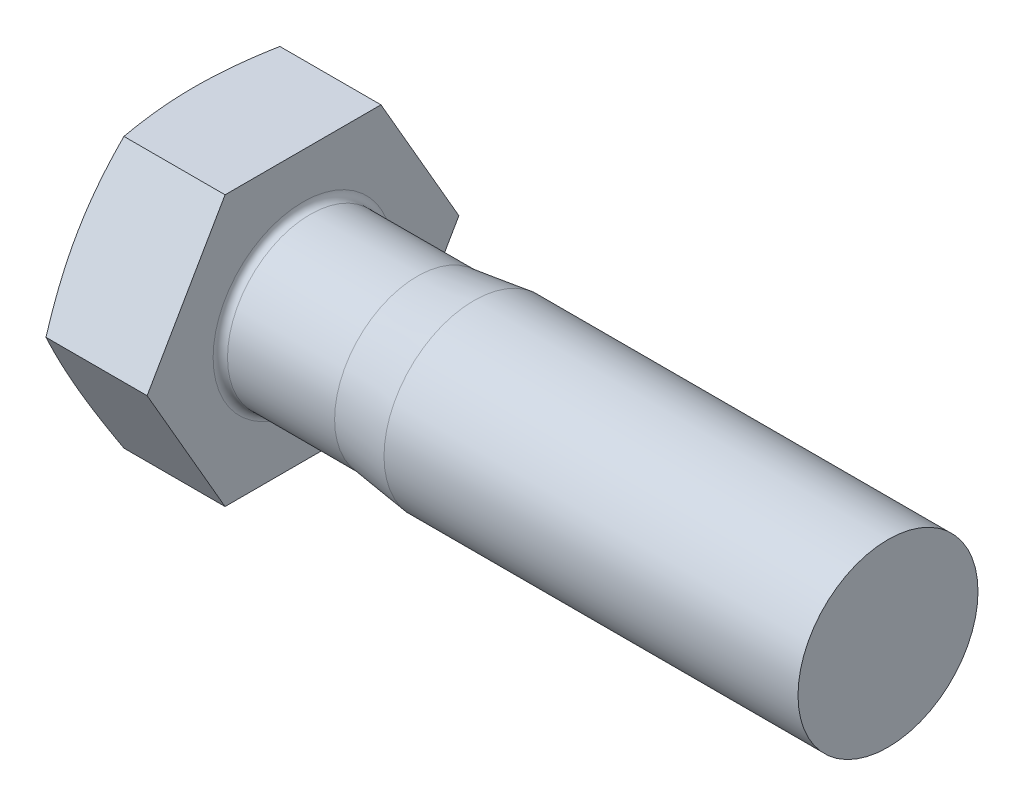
ISO-10303-21;
HEADER;
FILE_DESCRIPTION(('STEP AP214'),'2;1');
FILE_NAME('part.step','',(''),(''),'','','');
FILE_SCHEMA(('AUTOMOTIVE_DESIGN { 1 0 10303 214 1 1 1 1 }'));
ENDSEC;
DATA;
#1=APPLICATION_CONTEXT('core data for automotive mechanical design processes');
#2=APPLICATION_PROTOCOL_DEFINITION('international standard','automotive_design',2000,#1);
#3=PRODUCT_CONTEXT('',#1,'mechanical');
#4=PRODUCT('Part','Part','',(#3));
#5=PRODUCT_RELATED_PRODUCT_CATEGORY('part','',(#4));
#6=PRODUCT_DEFINITION_FORMATION('','',#4);
#7=PRODUCT_DEFINITION_CONTEXT('part definition',#1,'design');
#8=PRODUCT_DEFINITION('design','',#6,#7);
#9=PRODUCT_DEFINITION_SHAPE('','',#8);
#10=(LENGTH_UNIT() NAMED_UNIT(*) SI_UNIT(.MILLI.,.METRE.));
#11=(NAMED_UNIT(*) PLANE_ANGLE_UNIT() SI_UNIT($,.RADIAN.));
#12=(NAMED_UNIT(*) SI_UNIT($,.STERADIAN.) SOLID_ANGLE_UNIT());
#13=UNCERTAINTY_MEASURE_WITH_UNIT(LENGTH_MEASURE(1.E-05),#10,'distance_accuracy_value','');
#14=(GEOMETRIC_REPRESENTATION_CONTEXT(3) GLOBAL_UNCERTAINTY_ASSIGNED_CONTEXT((#13)) GLOBAL_UNIT_ASSIGNED_CONTEXT((#10,
#11,#12)) REPRESENTATION_CONTEXT('',''));
#15=CARTESIAN_POINT('',(0.,0.,0.));
#16=DIRECTION('',(0.,0.,1.));
#17=DIRECTION('',(1.,0.,0.));
#18=AXIS2_PLACEMENT_3D('',#15,#16,#17);
#19=CARTESIAN_POINT('',(12.5,-15.,-8.66025403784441));
#20=DIRECTION('',(0.,0.5,0.866025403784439));
#21=DIRECTION('',(0.,-0.866025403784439,0.5));
#22=AXIS2_PLACEMENT_3D('',#19,#20,#21);
#23=PLANE('',#22);
#24=CARTESIAN_POINT('',(1.26320366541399,0.000200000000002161,-17.3206235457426));
#25=CARTESIAN_POINT('',(1.1979300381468,-0.310443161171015,-17.1412736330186));
#26=CARTESIAN_POINT('',(1.13559192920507,-0.621542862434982,-16.9616601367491));
#27=CARTESIAN_POINT('',(1.01743252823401,-1.24469773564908,-16.6018815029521));
#28=CARTESIAN_POINT('',(0.961611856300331,-1.55675299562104,-16.4217163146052));
#29=CARTESIAN_POINT('',(0.804840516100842,-2.49475901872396,-15.8801582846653));
#30=CARTESIAN_POINT('',(0.714672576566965,-3.12212058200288,-15.517950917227));
#31=CARTESIAN_POINT('',(0.605089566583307,-4.06237563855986,-14.9750944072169));
#32=CARTESIAN_POINT('',(0.572932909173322,-4.37418429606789,-14.795071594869));
#33=CARTESIAN_POINT('',(0.5174007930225,-4.99838379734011,-14.4346898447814));
#34=CARTESIAN_POINT('',(0.494024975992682,-5.31077461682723,-14.2543309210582));
#35=CARTESIAN_POINT('',(0.456462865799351,-5.93586386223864,-13.8934354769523));
#36=CARTESIAN_POINT('',(0.442273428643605,-6.24856214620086,-13.7128990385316));
#37=CARTESIAN_POINT('',(0.423324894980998,-6.87417362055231,-13.3517020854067));
#38=CARTESIAN_POINT('',(0.418565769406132,-7.18708681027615,-13.1710415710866));
#39=CARTESIAN_POINT('',(0.418565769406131,-7.81291318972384,-12.8097205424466));
#40=CARTESIAN_POINT('',(0.423324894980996,-8.12582637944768,-12.6290600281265));
#41=CARTESIAN_POINT('',(0.442273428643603,-8.75143785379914,-12.2678630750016));
#42=CARTESIAN_POINT('',(0.45646286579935,-9.06413613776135,-12.0873266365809));
#43=CARTESIAN_POINT('',(0.49402497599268,-9.68922538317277,-11.726431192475));
#44=CARTESIAN_POINT('',(0.517400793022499,-10.0016162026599,-11.5460722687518));
#45=CARTESIAN_POINT('',(0.57293290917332,-10.6258157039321,-11.1856905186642));
#46=CARTESIAN_POINT('',(0.605089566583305,-10.9376243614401,-11.0056677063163));
#47=CARTESIAN_POINT('',(0.714672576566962,-11.8778794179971,-10.4628111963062));
#48=CARTESIAN_POINT('',(0.804840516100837,-12.505240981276,-10.1006038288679));
#49=CARTESIAN_POINT('',(0.961611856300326,-13.443247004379,-9.55904579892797));
#50=CARTESIAN_POINT('',(1.017432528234,-13.7553022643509,-9.37888061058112));
#51=CARTESIAN_POINT('',(1.13559192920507,-14.378457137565,-9.01910197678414));
#52=CARTESIAN_POINT('',(1.19793003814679,-14.689556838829,-8.83948848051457));
#53=CARTESIAN_POINT('',(1.26320366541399,-15.0002,-8.66013856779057));
#54=B_SPLINE_CURVE_WITH_KNOTS('',3,(#24,#25,#26,#27,#28,#29,#30,#31,#32,#33,#34,#35,#36,#37,#38,
#39,#40,#41,#42,#43,#44,#45,#46,#47,#48,#49,#50,#51,#52,#53),.UNSPECIFIED.,.F.,.F.,(4,2,2,2,2,2,
2,2,2,2,2,2,2,2,4),(0.,1.0937389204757,2.18758181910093,4.37677976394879,5.46113055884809,
6.54543710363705,7.62937235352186,8.71330426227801,9.79723617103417,10.881171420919,
11.9654779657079,13.0498287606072,15.2390267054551,16.3328696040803,17.426608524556),.UNSPECIFIED.);
#55=CARTESIAN_POINT('',(1.26316163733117,0.,-17.3205080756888));
#56=VERTEX_POINT('',#55);
#57=CARTESIAN_POINT('',(1.26316163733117,-15.,-8.66025403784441));
#58=VERTEX_POINT('',#57);
#59=EDGE_CURVE('E47',#56,#58,#54,.T.);
#60=ORIENTED_EDGE('',*,*,#59,.F.);
#61=DIRECTION('',(-1.,0.,0.));
#62=VECTOR('',#61,1.);
#63=CARTESIAN_POINT('',(12.5,0.,-17.3205080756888));
#64=LINE('',#63,#62);
#65=CARTESIAN_POINT('',(12.5,0.,-17.3205080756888));
#66=VERTEX_POINT('',#65);
#67=EDGE_CURVE('E118',#66,#56,#64,.T.);
#68=ORIENTED_EDGE('',*,*,#67,.F.);
#69=DIRECTION('',(0.,0.866025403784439,-0.5));
#70=VECTOR('',#69,1.);
#71=CARTESIAN_POINT('',(12.5,-15.,-8.66025403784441));
#72=LINE('',#71,#70);
#73=CARTESIAN_POINT('',(12.5,-15.,-8.66025403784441));
#74=VERTEX_POINT('',#73);
#75=EDGE_CURVE('E157',#74,#66,#72,.T.);
#76=ORIENTED_EDGE('',*,*,#75,.F.);
#77=DIRECTION('',(-1.,0.,0.));
#78=VECTOR('',#77,1.);
#79=CARTESIAN_POINT('',(12.5,-15.,-8.66025403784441));
#80=LINE('',#79,#78);
#81=EDGE_CURVE('E112',#74,#58,#80,.T.);
#82=ORIENTED_EDGE('',*,*,#81,.T.);
#83=EDGE_LOOP('',(#60,#68,#76,#82));
#84=FACE_BOUND('',#83,.T.);
#85=ADVANCED_FACE('F32',(#84),#23,.F.);
#86=CARTESIAN_POINT('',(12.5,0.,-17.3205080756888));
#87=DIRECTION('',(0.,-0.5,0.866025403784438));
#88=DIRECTION('',(0.,-0.866025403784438,-0.5));
#89=AXIS2_PLACEMENT_3D('',#86,#87,#88);
#90=PLANE('',#89);
#91=CARTESIAN_POINT('',(1.26320366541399,15.0002,-8.66013856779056));
#92=CARTESIAN_POINT('',(1.19793003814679,14.689556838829,-8.83948848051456));
#93=CARTESIAN_POINT('',(1.13559192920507,14.378457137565,-9.01910197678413));
#94=CARTESIAN_POINT('',(1.017432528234,13.7553022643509,-9.37888061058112));
#95=CARTESIAN_POINT('',(0.961611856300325,13.443247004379,-9.55904579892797));
#96=CARTESIAN_POINT('',(0.804840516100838,12.505240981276,-10.1006038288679));
#97=CARTESIAN_POINT('',(0.71467257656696,11.8778794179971,-10.4628111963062));
#98=CARTESIAN_POINT('',(0.605089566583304,10.9376243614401,-11.0056677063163));
#99=CARTESIAN_POINT('',(0.572932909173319,10.6258157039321,-11.1856905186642));
#100=CARTESIAN_POINT('',(0.517400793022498,10.0016162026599,-11.5460722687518));
#101=CARTESIAN_POINT('',(0.49402497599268,9.68922538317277,-11.726431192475));
#102=CARTESIAN_POINT('',(0.456462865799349,9.06413613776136,-12.0873266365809));
#103=CARTESIAN_POINT('',(0.442273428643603,8.75143785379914,-12.2678630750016));
#104=CARTESIAN_POINT('',(0.423324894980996,8.12582637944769,-12.6290600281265));
#105=CARTESIAN_POINT('',(0.41856576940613,7.81291318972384,-12.8097205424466));
#106=CARTESIAN_POINT('',(0.418565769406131,7.18708681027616,-13.1710415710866));
#107=CARTESIAN_POINT('',(0.423324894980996,6.87417362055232,-13.3517020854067));
#108=CARTESIAN_POINT('',(0.442273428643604,6.24856214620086,-13.7128990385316));
#109=CARTESIAN_POINT('',(0.456462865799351,5.93586386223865,-13.8934354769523));
#110=CARTESIAN_POINT('',(0.494024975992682,5.31077461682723,-14.2543309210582));
#111=CARTESIAN_POINT('',(0.5174007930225,4.99838379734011,-14.4346898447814));
#112=CARTESIAN_POINT('',(0.572932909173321,4.37418429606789,-14.795071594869));
#113=CARTESIAN_POINT('',(0.605089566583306,4.06237563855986,-14.9750944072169));
#114=CARTESIAN_POINT('',(0.714672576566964,3.12212058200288,-15.517950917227));
#115=CARTESIAN_POINT('',(0.804840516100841,2.49475901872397,-15.8801582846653));
#116=CARTESIAN_POINT('',(0.96161185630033,1.55675299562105,-16.4217163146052));
#117=CARTESIAN_POINT('',(1.017432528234,1.24469773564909,-16.6018815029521));
#118=CARTESIAN_POINT('',(1.13559192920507,0.621542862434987,-16.9616601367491));
#119=CARTESIAN_POINT('',(1.1979300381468,0.31044316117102,-17.1412736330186));
#120=CARTESIAN_POINT('',(1.26320366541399,-0.000199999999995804,-17.3206235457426));
#121=B_SPLINE_CURVE_WITH_KNOTS('',3,(#91,#92,#93,#94,#95,#96,#97,#98,#99,#100,#101,#102,#103,
#104,#105,#106,#107,#108,#109,#110,#111,#112,#113,#114,#115,#116,#117,#118,#119,#120),
.UNSPECIFIED.,.F.,.F.,(4,2,2,2,2,2,2,2,2,2,2,2,2,2,4),(0.,1.0937389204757,2.18758181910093,
4.37677976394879,5.46113055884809,6.54543710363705,7.62937235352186,8.71330426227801,
9.79723617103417,10.881171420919,11.9654779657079,13.0498287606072,15.2390267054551,
16.3328696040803,17.426608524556),.UNSPECIFIED.);
#122=CARTESIAN_POINT('',(1.26316163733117,15.,-8.66025403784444));
#123=VERTEX_POINT('',#122);
#124=EDGE_CURVE('E150',#123,#56,#121,.T.);
#125=ORIENTED_EDGE('',*,*,#124,.F.);
#126=DIRECTION('',(-1.,0.,0.));
#127=VECTOR('',#126,1.);
#128=CARTESIAN_POINT('',(12.5,15.,-8.6602540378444));
#129=LINE('',#128,#127);
#130=CARTESIAN_POINT('',(12.5,15.,-8.6602540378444));
#131=VERTEX_POINT('',#130);
#132=EDGE_CURVE('E110',#131,#123,#129,.T.);
#133=ORIENTED_EDGE('',*,*,#132,.F.);
#134=DIRECTION('',(0.,0.866025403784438,0.5));
#135=VECTOR('',#134,1.);
#136=CARTESIAN_POINT('',(12.5,0.,-17.3205080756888));
#137=LINE('',#136,#135);
#138=EDGE_CURVE('E154',#66,#131,#137,.T.);
#139=ORIENTED_EDGE('',*,*,#138,.F.);
#140=ORIENTED_EDGE('',*,*,#67,.T.);
#141=EDGE_LOOP('',(#125,#133,#139,#140));
#142=FACE_BOUND('',#141,.T.);
#143=ADVANCED_FACE('F139',(#142),#90,.F.);
#144=CARTESIAN_POINT('',(12.5,15.,-8.6602540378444));
#145=DIRECTION('',(0.,-1.,0.));
#146=DIRECTION('',(0.,0.,-1.));
#147=AXIS2_PLACEMENT_3D('',#144,#145,#146);
#148=PLANE('',#147);
#149=CARTESIAN_POINT('',(4.91961642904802,15.,-22.88945697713));
#150=CARTESIAN_POINT('',(4.81638202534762,15.,-22.5503381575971));
#151=CARTESIAN_POINT('',(4.71377422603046,15.,-22.2110286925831));
#152=CARTESIAN_POINT('',(4.50995213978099,15.,-21.5319894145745));
#153=CARTESIAN_POINT('',(4.40873786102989,15.,-21.1922595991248));
#154=CARTESIAN_POINT('',(4.10738262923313,15.,-20.1723364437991));
#155=CARTESIAN_POINT('',(3.9095446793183,15.,-19.4914598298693));
#156=CARTESIAN_POINT('',(3.52106014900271,15.,-18.1262692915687));
#157=CARTESIAN_POINT('',(3.3304277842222,15.,-17.4419513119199));
#158=CARTESIAN_POINT('',(2.95858022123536,15.,-16.0707644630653));
#159=CARTESIAN_POINT('',(2.7773648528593,15.,-15.383895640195));
#160=CARTESIAN_POINT('',(2.42886947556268,15.,-14.0157131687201));
#161=CARTESIAN_POINT('',(2.26144414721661,15.,-13.3344367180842));
#162=CARTESIAN_POINT('',(1.94090770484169,15.,-11.9684892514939));
#163=CARTESIAN_POINT('',(1.78779683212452,15.,-11.283818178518));
#164=CARTESIAN_POINT('',(1.49947213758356,15.,-9.91093551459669));
#165=CARTESIAN_POINT('',(1.3642520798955,15.,-9.22272524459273));
#166=CARTESIAN_POINT('',(1.11583728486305,15.,-7.84231132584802));
#167=CARTESIAN_POINT('',(1.00264180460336,15.,-7.15010781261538));
#168=CARTESIAN_POINT('',(0.814095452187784,15.,-5.83972391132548));
#169=CARTESIAN_POINT('',(0.735923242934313,15.,-5.22195329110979));
#170=CARTESIAN_POINT('',(0.603729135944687,15.,-3.98381199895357));
#171=CARTESIAN_POINT('',(0.549706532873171,15.,-3.36344140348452));
#172=CARTESIAN_POINT('',(0.468413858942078,15.,-2.12135926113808));
#173=CARTESIAN_POINT('',(0.441125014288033,15.,-1.49964896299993));
#174=CARTESIAN_POINT('',(0.414680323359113,15.,-0.25562387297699));
#175=CARTESIAN_POINT('',(0.415524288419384,15.,0.366690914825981));
#176=CARTESIAN_POINT('',(0.445375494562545,15.,1.61382375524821));
#177=CARTESIAN_POINT('',(0.47452701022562,15.,2.23863829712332));
#178=CARTESIAN_POINT('',(0.559653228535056,15.,3.4864216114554));
#179=CARTESIAN_POINT('',(0.615628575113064,15.,4.10939033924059));
#180=CARTESIAN_POINT('',(0.75179235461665,15.,5.35317883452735));
#181=CARTESIAN_POINT('',(0.832001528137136,15.,5.97399629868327));
#182=CARTESIAN_POINT('',(1.01339112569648,15.,7.21252509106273));
#183=CARTESIAN_POINT('',(1.11457165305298,15.,7.83023640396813));
#184=CARTESIAN_POINT('',(1.3410206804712,15.,9.09829177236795));
#185=CARTESIAN_POINT('',(1.4673476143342,15.,9.74844514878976));
#186=CARTESIAN_POINT('',(1.73625904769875,15.,11.0454025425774));
#187=CARTESIAN_POINT('',(1.87884478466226,15.,11.6922063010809));
#188=CARTESIAN_POINT('',(2.1772678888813,15.,12.982930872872));
#189=CARTESIAN_POINT('',(2.3331091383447,15.,13.6268507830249));
#190=CARTESIAN_POINT('',(2.65550076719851,15.,14.9119744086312));
#191=CARTESIAN_POINT('',(2.82205088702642,15.,15.553178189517));
#192=CARTESIAN_POINT('',(3.16407229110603,15.,16.8340800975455));
#193=CARTESIAN_POINT('',(3.33955481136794,15.,17.4737752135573));
#194=CARTESIAN_POINT('',(3.6976366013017,15.,18.7511677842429));
#195=CARTESIAN_POINT('',(3.88023590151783,15.,19.3888652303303));
#196=CARTESIAN_POINT('',(4.25124466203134,15.,20.6624469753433));
#197=CARTESIAN_POINT('',(4.43965313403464,15.,21.2983315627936));
#198=CARTESIAN_POINT('',(4.82129800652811,15.,22.5686463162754));
#199=CARTESIAN_POINT('',(5.01453439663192,15.,23.2030764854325));
#200=CARTESIAN_POINT('',(5.40282045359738,15.,24.4635306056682));
#201=CARTESIAN_POINT('',(5.59782491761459,15.,25.0895684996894));
#202=CARTESIAN_POINT('',(5.99114351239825,15.,26.3406044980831));
#203=CARTESIAN_POINT('',(6.18945765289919,15.,26.9656025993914));
#204=CARTESIAN_POINT('',(6.78859722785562,15.,28.8393146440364));
#205=CARTESIAN_POINT('',(7.19360294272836,15.,30.086691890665));
#206=CARTESIAN_POINT('',(8.01018214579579,15.,32.5740343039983));
#207=CARTESIAN_POINT('',(8.42172481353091,15.,33.8140096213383));
#208=CARTESIAN_POINT('',(9.04358172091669,15.,35.6723940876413));
#209=CARTESIAN_POINT('',(9.25161601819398,15.,36.29156752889));
#210=CARTESIAN_POINT('',(9.66902287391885,15.,37.5294615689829));
#211=CARTESIAN_POINT('',(9.87839542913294,15.,38.1481821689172));
#212=CARTESIAN_POINT('',(10.0883469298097,15.,38.7667061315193));
#213=B_SPLINE_CURVE_WITH_KNOTS('',3,(#149,#150,#151,#152,#153,#154,#155,#156,#157,#158,#159,
#160,#161,#162,#163,#164,#165,#166,#167,#168,#169,#170,#171,#172,#173,#174,#175,#176,#177,#178,
#179,#180,#181,#182,#183,#184,#185,#186,#187,#188,#189,#190,#191,#192,#193,#194,#195,#196,#197,
#198,#199,#200,#201,#202,#203,#204,#205,#206,#207,#208,#209,#210,#211,#212),.UNSPECIFIED.,.F.,
.F.,(4,2,2,2,2,2,2,2,2,2,2,2,2,2,2,2,2,2,2,2,2,2,2,2,2,2,2,2,2,2,2,4),(0.,1.06345090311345,
2.12690804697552,4.25398052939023,6.38505099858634,8.51608294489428,10.6206032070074,
12.7251589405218,14.8289791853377,16.9327284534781,18.8004079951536,20.6680329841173,
22.5343454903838,24.4006454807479,26.2765076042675,28.1524147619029,30.0299319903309,
31.9074584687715,33.8941406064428,35.8809740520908,37.8683914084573,39.8557606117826,
41.8456946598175,43.8356372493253,45.8252431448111,47.8148447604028,49.7819514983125,
51.7490640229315,55.6834600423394,59.6028993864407,61.5624608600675,63.5220176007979),.UNSPECIFIED.);
#214=CARTESIAN_POINT('',(1.26316163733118,15.0000000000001,8.66025403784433));
#215=VERTEX_POINT('',#214);
#216=EDGE_CURVE('E104',#215,#123,#213,.F.);
#217=ORIENTED_EDGE('',*,*,#216,.F.);
#218=DIRECTION('',(-1.,0.,0.));
#219=VECTOR('',#218,1.);
#220=CARTESIAN_POINT('',(12.5,15.,8.66025403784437));
#221=LINE('',#220,#219);
#222=CARTESIAN_POINT('',(12.5,15.,8.66025403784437));
#223=VERTEX_POINT('',#222);
#224=EDGE_CURVE('E103',#223,#215,#221,.T.);
#225=ORIENTED_EDGE('',*,*,#224,.F.);
#226=DIRECTION('',(0.,0.,1.));
#227=VECTOR('',#226,1.);
#228=CARTESIAN_POINT('',(12.5,15.,-8.6602540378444));
#229=LINE('',#228,#227);
#230=EDGE_CURVE('E156',#131,#223,#229,.T.);
#231=ORIENTED_EDGE('',*,*,#230,.F.);
#232=ORIENTED_EDGE('',*,*,#132,.T.);
#233=EDGE_LOOP('',(#217,#225,#231,#232));
#234=FACE_BOUND('',#233,.T.);
#235=ADVANCED_FACE('F144',(#234),#148,.F.);
#236=CARTESIAN_POINT('',(12.5,15.,8.66025403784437));
#237=DIRECTION('',(0.,-0.5,-0.866025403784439));
#238=DIRECTION('',(0.,0.866025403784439,-0.5));
#239=AXIS2_PLACEMENT_3D('',#236,#237,#238);
#240=PLANE('',#239);
#241=CARTESIAN_POINT('',(1.26320366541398,-0.000199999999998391,17.3206235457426));
#242=CARTESIAN_POINT('',(1.19793003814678,0.310443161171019,17.1412736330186));
#243=CARTESIAN_POINT('',(1.13559192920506,0.621542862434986,16.961660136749));
#244=CARTESIAN_POINT('',(1.01743252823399,1.24469773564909,16.601881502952));
#245=CARTESIAN_POINT('',(0.961611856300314,1.55675299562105,16.4217163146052));
#246=CARTESIAN_POINT('',(0.804840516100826,2.49475901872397,15.8801582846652));
#247=CARTESIAN_POINT('',(0.714672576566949,3.12212058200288,15.5179509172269));
#248=CARTESIAN_POINT('',(0.605089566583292,4.06237563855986,14.9750944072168));
#249=CARTESIAN_POINT('',(0.572932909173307,4.37418429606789,14.7950715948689));
#250=CARTESIAN_POINT('',(0.517400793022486,4.99838379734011,14.4346898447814));
#251=CARTESIAN_POINT('',(0.494024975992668,5.31077461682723,14.2543309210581));
#252=CARTESIAN_POINT('',(0.456462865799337,5.93586386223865,13.8934354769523));
#253=CARTESIAN_POINT('',(0.442273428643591,6.24856214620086,13.7128990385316));
#254=CARTESIAN_POINT('',(0.423324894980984,6.87417362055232,13.3517020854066));
#255=CARTESIAN_POINT('',(0.418565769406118,7.18708681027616,13.1710415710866));
#256=CARTESIAN_POINT('',(0.418565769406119,7.81291318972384,12.8097205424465));
#257=CARTESIAN_POINT('',(0.423324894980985,8.12582637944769,12.6290600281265));
#258=CARTESIAN_POINT('',(0.442273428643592,8.75143785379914,12.2678630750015));
#259=CARTESIAN_POINT('',(0.456462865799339,9.06413613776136,12.0873266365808));
#260=CARTESIAN_POINT('',(0.494024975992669,9.68922538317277,11.726431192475));
#261=CARTESIAN_POINT('',(0.517400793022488,10.0016162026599,11.5460722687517));
#262=CARTESIAN_POINT('',(0.572932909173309,10.6258157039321,11.1856905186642));
#263=CARTESIAN_POINT('',(0.605089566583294,10.9376243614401,11.0056677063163));
#264=CARTESIAN_POINT('',(0.714672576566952,11.8778794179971,10.4628111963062));
#265=CARTESIAN_POINT('',(0.804840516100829,12.505240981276,10.1006038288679));
#266=CARTESIAN_POINT('',(0.961611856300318,13.443247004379,9.55904579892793));
#267=CARTESIAN_POINT('',(1.01743252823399,13.7553022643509,9.37888061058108));
#268=CARTESIAN_POINT('',(1.13559192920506,14.378457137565,9.01910197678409));
#269=CARTESIAN_POINT('',(1.19793003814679,14.689556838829,8.83948848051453));
#270=CARTESIAN_POINT('',(1.26320366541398,15.0002,8.66013856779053));
#271=B_SPLINE_CURVE_WITH_KNOTS('',3,(#241,#242,#243,#244,#245,#246,#247,#248,#249,#250,#251,
#252,#253,#254,#255,#256,#257,#258,#259,#260,#261,#262,#263,#264,#265,#266,#267,#268,#269,#270),
.UNSPECIFIED.,.F.,.F.,(4,2,2,2,2,2,2,2,2,2,2,2,2,2,4),(0.,1.0937389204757,2.18758181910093,
4.37677976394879,5.46113055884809,6.54543710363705,7.62937235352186,8.71330426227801,
9.79723617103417,10.881171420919,11.9654779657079,13.0498287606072,15.2390267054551,
16.3328696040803,17.426608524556),.UNSPECIFIED.);
#272=CARTESIAN_POINT('',(1.26316163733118,0.,17.3205080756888));
#273=VERTEX_POINT('',#272);
#274=EDGE_CURVE('E87',#273,#215,#271,.T.);
#275=ORIENTED_EDGE('',*,*,#274,.F.);
#276=DIRECTION('',(-1.,0.,0.));
#277=VECTOR('',#276,1.);
#278=CARTESIAN_POINT('',(12.5,0.,17.3205080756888));
#279=LINE('',#278,#277);
#280=CARTESIAN_POINT('',(12.5,0.,17.3205080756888));
#281=VERTEX_POINT('',#280);
#282=EDGE_CURVE('E100',#281,#273,#279,.T.);
#283=ORIENTED_EDGE('',*,*,#282,.F.);
#284=DIRECTION('',(0.,-0.866025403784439,0.5));
#285=VECTOR('',#284,1.);
#286=CARTESIAN_POINT('',(12.5,15.,8.66025403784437));
#287=LINE('',#286,#285);
#288=EDGE_CURVE('E164',#223,#281,#287,.T.);
#289=ORIENTED_EDGE('',*,*,#288,.F.);
#290=ORIENTED_EDGE('',*,*,#224,.T.);
#291=EDGE_LOOP('',(#275,#283,#289,#290));
#292=FACE_BOUND('',#291,.T.);
#293=ADVANCED_FACE('F98',(#292),#240,.F.);
#294=CARTESIAN_POINT('',(12.5,0.,17.3205080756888));
#295=DIRECTION('',(0.,0.5,-0.866025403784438));
#296=DIRECTION('',(0.,0.866025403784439,0.5));
#297=AXIS2_PLACEMENT_3D('',#294,#295,#296);
#298=PLANE('',#297);
#299=CARTESIAN_POINT('',(1.26320366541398,-15.0002,8.66013856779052));
#300=CARTESIAN_POINT('',(1.19793003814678,-14.689556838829,8.83948848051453));
#301=CARTESIAN_POINT('',(1.13559192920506,-14.378457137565,9.01910197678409));
#302=CARTESIAN_POINT('',(1.01743252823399,-13.7553022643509,9.37888061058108));
#303=CARTESIAN_POINT('',(0.961611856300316,-13.443247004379,9.55904579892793));
#304=CARTESIAN_POINT('',(0.804840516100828,-12.505240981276,10.1006038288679));
#305=CARTESIAN_POINT('',(0.714672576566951,-11.8778794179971,10.4628111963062));
#306=CARTESIAN_POINT('',(0.605089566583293,-10.9376243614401,11.0056677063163));
#307=CARTESIAN_POINT('',(0.572932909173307,-10.6258157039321,11.1856905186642));
#308=CARTESIAN_POINT('',(0.517400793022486,-10.0016162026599,11.5460722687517));
#309=CARTESIAN_POINT('',(0.494024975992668,-9.68922538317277,11.726431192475));
#310=CARTESIAN_POINT('',(0.456462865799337,-9.06413613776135,12.0873266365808));
#311=CARTESIAN_POINT('',(0.44227342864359,-8.75143785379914,12.2678630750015));
#312=CARTESIAN_POINT('',(0.423324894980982,-8.12582637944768,12.6290600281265));
#313=CARTESIAN_POINT('',(0.418565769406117,-7.81291318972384,12.8097205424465));
#314=CARTESIAN_POINT('',(0.418565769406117,-7.18708681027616,13.1710415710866));
#315=CARTESIAN_POINT('',(0.423324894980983,-6.87417362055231,13.3517020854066));
#316=CARTESIAN_POINT('',(0.44227342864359,-6.24856214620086,13.7128990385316));
#317=CARTESIAN_POINT('',(0.456462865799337,-5.93586386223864,13.8934354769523));
#318=CARTESIAN_POINT('',(0.494024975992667,-5.31077461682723,14.2543309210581));
#319=CARTESIAN_POINT('',(0.517400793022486,-4.99838379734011,14.4346898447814));
#320=CARTESIAN_POINT('',(0.572932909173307,-4.37418429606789,14.7950715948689));
#321=CARTESIAN_POINT('',(0.605089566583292,-4.06237563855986,14.9750944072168));
#322=CARTESIAN_POINT('',(0.714672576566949,-3.12212058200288,15.5179509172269));
#323=CARTESIAN_POINT('',(0.804840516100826,-2.49475901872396,15.8801582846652));
#324=CARTESIAN_POINT('',(0.961611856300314,-1.55675299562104,16.4217163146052));
#325=CARTESIAN_POINT('',(1.01743252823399,-1.24469773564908,16.601881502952));
#326=CARTESIAN_POINT('',(1.13559192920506,-0.621542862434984,16.961660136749));
#327=CARTESIAN_POINT('',(1.19793003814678,-0.310443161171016,17.1412736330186));
#328=CARTESIAN_POINT('',(1.26320366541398,0.000200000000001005,17.3206235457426));
#329=B_SPLINE_CURVE_WITH_KNOTS('',3,(#299,#300,#301,#302,#303,#304,#305,#306,#307,#308,#309,
#310,#311,#312,#313,#314,#315,#316,#317,#318,#319,#320,#321,#322,#323,#324,#325,#326,#327,#328),
.UNSPECIFIED.,.F.,.F.,(4,2,2,2,2,2,2,2,2,2,2,2,2,2,4),(0.,1.0937389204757,2.18758181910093,
4.37677976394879,5.46113055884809,6.54543710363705,7.62937235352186,8.71330426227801,
9.79723617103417,10.881171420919,11.9654779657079,13.0498287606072,15.2390267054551,
16.3328696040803,17.426608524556),.UNSPECIFIED.);
#330=CARTESIAN_POINT('',(1.26316163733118,-15.,8.66025403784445));
#331=VERTEX_POINT('',#330);
#332=EDGE_CURVE('E84',#331,#273,#329,.T.);
#333=ORIENTED_EDGE('',*,*,#332,.F.);
#334=DIRECTION('',(-1.,0.,0.));
#335=VECTOR('',#334,1.);
#336=CARTESIAN_POINT('',(12.5,-15.,8.66025403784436));
#337=LINE('',#336,#335);
#338=CARTESIAN_POINT('',(12.5,-15.,8.66025403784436));
#339=VERTEX_POINT('',#338);
#340=EDGE_CURVE('E108',#339,#331,#337,.T.);
#341=ORIENTED_EDGE('',*,*,#340,.F.);
#342=DIRECTION('',(0.,-0.866025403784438,-0.5));
#343=VECTOR('',#342,1.);
#344=CARTESIAN_POINT('',(12.5,0.,17.3205080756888));
#345=LINE('',#344,#343);
#346=EDGE_CURVE('E107',#281,#339,#345,.T.);
#347=ORIENTED_EDGE('',*,*,#346,.F.);
#348=ORIENTED_EDGE('',*,*,#282,.T.);
#349=EDGE_LOOP('',(#333,#341,#347,#348));
#350=FACE_BOUND('',#349,.T.);
#351=ADVANCED_FACE('F106',(#350),#298,.F.);
#352=CARTESIAN_POINT('',(12.5,-15.,8.66025403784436));
#353=DIRECTION('',(0.,1.,0.));
#354=DIRECTION('',(0.,0.,1.));
#355=AXIS2_PLACEMENT_3D('',#352,#353,#354);
#356=PLANE('',#355);
#357=CARTESIAN_POINT('',(4.91961642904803,-15.,-22.88945697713));
#358=CARTESIAN_POINT('',(4.81638202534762,-15.,-22.5503381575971));
#359=CARTESIAN_POINT('',(4.71377422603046,-15.,-22.2110286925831));
#360=CARTESIAN_POINT('',(4.509952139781,-15.,-21.5319894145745));
#361=CARTESIAN_POINT('',(4.4087378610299,-15.,-21.1922595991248));
#362=CARTESIAN_POINT('',(4.10738262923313,-15.,-20.1723364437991));
#363=CARTESIAN_POINT('',(3.9095446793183,-15.,-19.4914598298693));
#364=CARTESIAN_POINT('',(3.52106014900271,-15.,-18.1262692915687));
#365=CARTESIAN_POINT('',(3.3304277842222,-15.,-17.4419513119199));
#366=CARTESIAN_POINT('',(2.95858022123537,-15.,-16.0707644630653));
#367=CARTESIAN_POINT('',(2.7773648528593,-15.,-15.383895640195));
#368=CARTESIAN_POINT('',(2.42886947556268,-15.,-14.0157131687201));
#369=CARTESIAN_POINT('',(2.26144414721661,-15.,-13.3344367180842));
#370=CARTESIAN_POINT('',(1.94090770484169,-15.,-11.9684892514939));
#371=CARTESIAN_POINT('',(1.78779683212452,-15.,-11.283818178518));
#372=CARTESIAN_POINT('',(1.49947213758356,-15.,-9.91093551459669));
#373=CARTESIAN_POINT('',(1.3642520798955,-15.,-9.22272524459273));
#374=CARTESIAN_POINT('',(1.11583728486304,-15.,-7.84231132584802));
#375=CARTESIAN_POINT('',(1.00264180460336,-15.,-7.15010781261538));
#376=CARTESIAN_POINT('',(0.814095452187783,-15.,-5.83972391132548));
#377=CARTESIAN_POINT('',(0.735923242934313,-15.,-5.2219532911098));
#378=CARTESIAN_POINT('',(0.603729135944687,-15.,-3.98381199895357));
#379=CARTESIAN_POINT('',(0.54970653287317,-15.,-3.36344140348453));
#380=CARTESIAN_POINT('',(0.468413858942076,-15.,-2.12135926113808));
#381=CARTESIAN_POINT('',(0.441125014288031,-15.,-1.49964896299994));
#382=CARTESIAN_POINT('',(0.414680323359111,-15.,-0.255623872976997));
#383=CARTESIAN_POINT('',(0.415524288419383,-15.,0.366690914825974));
#384=CARTESIAN_POINT('',(0.445375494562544,-15.,1.6138237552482));
#385=CARTESIAN_POINT('',(0.474527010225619,-15.,2.23863829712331));
#386=CARTESIAN_POINT('',(0.559653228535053,-15.,3.48642161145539));
#387=CARTESIAN_POINT('',(0.615628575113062,-15.,4.10939033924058));
#388=CARTESIAN_POINT('',(0.751792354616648,-15.,5.35317883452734));
#389=CARTESIAN_POINT('',(0.832001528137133,-15.,5.97399629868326));
#390=CARTESIAN_POINT('',(1.01339112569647,-15.,7.21252509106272));
#391=CARTESIAN_POINT('',(1.11457165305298,-15.,7.83023640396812));
#392=CARTESIAN_POINT('',(1.3410206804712,-15.,9.09829177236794));
#393=CARTESIAN_POINT('',(1.4673476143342,-15.,9.74844514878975));
#394=CARTESIAN_POINT('',(1.73625904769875,-15.,11.0454025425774));
#395=CARTESIAN_POINT('',(1.87884478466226,-15.,11.6922063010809));
#396=CARTESIAN_POINT('',(2.1772678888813,-15.,12.9829308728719));
#397=CARTESIAN_POINT('',(2.3331091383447,-15.,13.6268507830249));
#398=CARTESIAN_POINT('',(2.65550076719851,-15.,14.9119744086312));
#399=CARTESIAN_POINT('',(2.82205088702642,-15.,15.553178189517));
#400=CARTESIAN_POINT('',(3.16407229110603,-15.,16.8340800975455));
#401=CARTESIAN_POINT('',(3.33955481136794,-15.,17.4737752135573));
#402=CARTESIAN_POINT('',(3.6976366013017,-15.,18.7511677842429));
#403=CARTESIAN_POINT('',(3.88023590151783,-15.,19.3888652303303));
#404=CARTESIAN_POINT('',(4.25124466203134,-15.,20.6624469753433));
#405=CARTESIAN_POINT('',(4.43965313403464,-15.,21.2983315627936));
#406=CARTESIAN_POINT('',(4.82129800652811,-15.,22.5686463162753));
#407=CARTESIAN_POINT('',(5.01453439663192,-15.,23.2030764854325));
#408=CARTESIAN_POINT('',(5.40282045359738,-15.,24.4635306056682));
#409=CARTESIAN_POINT('',(5.59782491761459,-15.,25.0895684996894));
#410=CARTESIAN_POINT('',(5.99114351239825,-15.,26.3406044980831));
#411=CARTESIAN_POINT('',(6.18945765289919,-15.,26.9656025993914));
#412=CARTESIAN_POINT('',(6.78859722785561,-15.,28.8393146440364));
#413=CARTESIAN_POINT('',(7.19360294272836,-15.,30.086691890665));
#414=CARTESIAN_POINT('',(8.01018214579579,-15.,32.5740343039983));
#415=CARTESIAN_POINT('',(8.4217248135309,-15.,33.8140096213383));
#416=CARTESIAN_POINT('',(9.04358172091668,-15.,35.6723940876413));
#417=CARTESIAN_POINT('',(9.25161601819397,-15.,36.29156752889));
#418=CARTESIAN_POINT('',(9.66902287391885,-15.,37.5294615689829));
#419=CARTESIAN_POINT('',(9.87839542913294,-15.,38.1481821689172));
#420=CARTESIAN_POINT('',(10.0883469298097,-15.,38.7667061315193));
#421=B_SPLINE_CURVE_WITH_KNOTS('',3,(#357,#358,#359,#360,#361,#362,#363,#364,#365,#366,#367,
#368,#369,#370,#371,#372,#373,#374,#375,#376,#377,#378,#379,#380,#381,#382,#383,#384,#385,#386,
#387,#388,#389,#390,#391,#392,#393,#394,#395,#396,#397,#398,#399,#400,#401,#402,#403,#404,#405,
#406,#407,#408,#409,#410,#411,#412,#413,#414,#415,#416,#417,#418,#419,#420),.UNSPECIFIED.,.F.,
.F.,(4,2,2,2,2,2,2,2,2,2,2,2,2,2,2,2,2,2,2,2,2,2,2,2,2,2,2,2,2,2,2,4),(0.,1.06345090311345,
2.12690804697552,4.25398052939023,6.38505099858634,8.51608294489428,10.6206032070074,
12.7251589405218,14.8289791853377,16.9327284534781,18.8004079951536,20.6680329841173,
22.5343454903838,24.4006454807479,26.2765076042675,28.1524147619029,30.0299319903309,
31.9074584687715,33.8941406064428,35.8809740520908,37.8683914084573,39.8557606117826,
41.8456946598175,43.8356372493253,45.8252431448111,47.8148447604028,49.7819514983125,
51.7490640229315,55.6834600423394,59.6028993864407,61.5624608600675,63.5220176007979),.UNSPECIFIED.);
#422=EDGE_CURVE('E89',#58,#331,#421,.T.);
#423=ORIENTED_EDGE('',*,*,#422,.F.);
#424=ORIENTED_EDGE('',*,*,#81,.F.);
#425=DIRECTION('',(0.,0.,-1.));
#426=VECTOR('',#425,1.);
#427=CARTESIAN_POINT('',(12.5,-15.,8.66025403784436));
#428=LINE('',#427,#426);
#429=EDGE_CURVE('E55',#339,#74,#428,.T.);
#430=ORIENTED_EDGE('',*,*,#429,.F.);
#431=ORIENTED_EDGE('',*,*,#340,.T.);
#432=EDGE_LOOP('',(#423,#424,#430,#431));
#433=FACE_BOUND('',#432,.T.);
#434=ADVANCED_FACE('F168',(#433),#356,.F.);
#435=CARTESIAN_POINT('',(12.5,0.,-17.3205080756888));
#436=DIRECTION('',(1.,0.,0.));
#437=DIRECTION('',(0.,0.,-1.));
#438=AXIS2_PLACEMENT_3D('',#435,#436,#437);
#439=PLANE('',#438);
#440=CARTESIAN_POINT('',(12.5,0.,0.));
#441=DIRECTION('',(1.,0.,0.));
#442=DIRECTION('',(0.,0.,-1.));
#443=AXIS2_PLACEMENT_3D('',#440,#441,#442);
#444=CIRCLE('',#443,9.988);
#445=CARTESIAN_POINT('',(12.5,0.,-9.988));
#446=VERTEX_POINT('',#445);
#447=EDGE_CURVE('E40',#446,#446,#444,.F.);
#448=ORIENTED_EDGE('',*,*,#447,.T.);
#449=EDGE_LOOP('',(#448));
#450=FACE_BOUND('',#449,.T.);
#451=ORIENTED_EDGE('',*,*,#75,.T.);
#452=ORIENTED_EDGE('',*,*,#138,.T.);
#453=ORIENTED_EDGE('',*,*,#230,.T.);
#454=ORIENTED_EDGE('',*,*,#288,.T.);
#455=ORIENTED_EDGE('',*,*,#346,.T.);
#456=ORIENTED_EDGE('',*,*,#429,.T.);
#457=EDGE_LOOP('',(#451,#452,#453,#454,#455,#456));
#458=FACE_BOUND('',#457,.T.);
#459=ADVANCED_FACE('F123',(#450,#458),#439,.T.);
#460=CARTESIAN_POINT('',(0.,0.,0.));
#461=DIRECTION('',(1.,0.,0.));
#462=DIRECTION('',(0.,0.,-1.));
#463=AXIS2_PLACEMENT_3D('',#460,#461,#462);
#464=CONICAL_SURFACE('',#463,13.85,1.22173047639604);
#465=CARTESIAN_POINT('',(0.,0.,0.));
#466=DIRECTION('',(-1.,0.,0.));
#467=DIRECTION('',(0.,0.,1.));
#468=AXIS2_PLACEMENT_3D('',#465,#466,#467);
#469=CIRCLE('',#468,13.85);
#470=CARTESIAN_POINT('',(0.,0.,13.85));
#471=VERTEX_POINT('',#470);
#472=EDGE_CURVE('E169',#471,#471,#469,.T.);
#473=ORIENTED_EDGE('',*,*,#472,.F.);
#474=EDGE_LOOP('',(#473));
#475=FACE_BOUND('',#474,.T.);
#476=ORIENTED_EDGE('',*,*,#59,.T.);
#477=ORIENTED_EDGE('',*,*,#422,.T.);
#478=ORIENTED_EDGE('',*,*,#332,.T.);
#479=ORIENTED_EDGE('',*,*,#274,.T.);
#480=ORIENTED_EDGE('',*,*,#216,.T.);
#481=ORIENTED_EDGE('',*,*,#124,.T.);
#482=EDGE_LOOP('',(#476,#477,#478,#479,#480,#481));
#483=FACE_BOUND('',#482,.T.);
#484=ADVANCED_FACE('F86',(#475,#483),#464,.T.);
#485=CARTESIAN_POINT('',(0.,0.,-17.3205080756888));
#486=DIRECTION('',(1.,0.,0.));
#487=DIRECTION('',(0.,0.,-1.));
#488=AXIS2_PLACEMENT_3D('',#485,#486,#487);
#489=PLANE('',#488);
#490=CARTESIAN_POINT('',(0.,0.,0.));
#491=DIRECTION('',(-1.,0.,0.));
#492=DIRECTION('',(0.,0.,1.));
#493=AXIS2_PLACEMENT_3D('',#490,#491,#492);
#494=CIRCLE('',#493,11.2);
#495=CARTESIAN_POINT('',(0.,0.,11.2));
#496=VERTEX_POINT('',#495);
#497=EDGE_CURVE('E242',#496,#496,#494,.T.);
#498=ORIENTED_EDGE('',*,*,#497,.F.);
#499=EDGE_LOOP('',(#498));
#500=FACE_BOUND('',#499,.T.);
#501=ORIENTED_EDGE('',*,*,#472,.T.);
#502=EDGE_LOOP('',(#501));
#503=FACE_BOUND('',#502,.T.);
#504=ADVANCED_FACE('F190',(#500,#503),#489,.F.);
#505=CARTESIAN_POINT('',(2.5,0.,0.));
#506=DIRECTION('',(-1.,0.,0.));
#507=DIRECTION('',(0.,0.,1.));
#508=AXIS2_PLACEMENT_3D('',#505,#506,#507);
#509=CYLINDRICAL_SURFACE('',#508,11.2);
#510=CARTESIAN_POINT('',(2.5,0.,0.));
#511=DIRECTION('',(-1.,0.,0.));
#512=DIRECTION('',(0.,0.,1.));
#513=AXIS2_PLACEMENT_3D('',#510,#511,#512);
#514=CIRCLE('',#513,11.2);
#515=CARTESIAN_POINT('',(2.5,0.,11.2));
#516=VERTEX_POINT('',#515);
#517=EDGE_CURVE('E172',#516,#516,#514,.T.);
#518=ORIENTED_EDGE('',*,*,#517,.F.);
#519=EDGE_LOOP('',(#518));
#520=FACE_BOUND('',#519,.T.);
#521=ORIENTED_EDGE('',*,*,#497,.T.);
#522=EDGE_LOOP('',(#521));
#523=FACE_BOUND('',#522,.T.);
#524=ADVANCED_FACE('F192',(#520,#523),#509,.F.);
#525=CARTESIAN_POINT('',(2.5,0.,0.));
#526=DIRECTION('',(-1.,0.,0.));
#527=DIRECTION('',(0.,0.,1.));
#528=AXIS2_PLACEMENT_3D('',#525,#526,#527);
#529=PLANE('',#528);
#530=ORIENTED_EDGE('',*,*,#517,.T.);
#531=EDGE_LOOP('',(#530));
#532=FACE_BOUND('',#531,.T.);
#533=ADVANCED_FACE('F237',(#532),#529,.T.);
#534=CARTESIAN_POINT('',(25.2,0.,0.));
#535=DIRECTION('',(1.,0.,0.));
#536=DIRECTION('',(0.,0.,-1.));
#537=AXIS2_PLACEMENT_3D('',#534,#535,#536);
#538=CONICAL_SURFACE('',#537,9.188,0.128182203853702);
#539=CARTESIAN_POINT('',(31.5,0.,0.));
#540=DIRECTION('',(-1.,0.,0.));
#541=DIRECTION('',(0.,0.,1.));
#542=AXIS2_PLACEMENT_3D('',#539,#540,#541);
#543=CIRCLE('',#542,10.);
#544=CARTESIAN_POINT('',(31.5,0.,9.99999999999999));
#545=VERTEX_POINT('',#544);
#546=EDGE_CURVE('E245',#545,#545,#543,.T.);
#547=ORIENTED_EDGE('',*,*,#546,.T.);
#548=EDGE_LOOP('',(#547));
#549=FACE_BOUND('',#548,.T.);
#550=CARTESIAN_POINT('',(25.2,0.,0.));
#551=DIRECTION('',(-1.,0.,0.));
#552=DIRECTION('',(0.,0.,1.));
#553=AXIS2_PLACEMENT_3D('',#550,#551,#552);
#554=CIRCLE('',#553,9.188);
#555=CARTESIAN_POINT('',(25.2,0.,9.188));
#556=VERTEX_POINT('',#555);
#557=EDGE_CURVE('E249',#556,#556,#554,.T.);
#558=ORIENTED_EDGE('',*,*,#557,.F.);
#559=EDGE_LOOP('',(#558));
#560=FACE_BOUND('',#559,.T.);
#561=ADVANCED_FACE('F257',(#549,#560),#538,.T.);
#562=CARTESIAN_POINT('',(-2.69717570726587,0.,0.));
#563=DIRECTION('',(-1.,0.,0.));
#564=DIRECTION('',(0.,0.,1.));
#565=AXIS2_PLACEMENT_3D('',#562,#563,#564);
#566=CYLINDRICAL_SURFACE('',#565,9.188);
#567=CARTESIAN_POINT('',(13.3,0.,0.));
#568=DIRECTION('',(1.,0.,0.));
#569=DIRECTION('',(0.,0.,-1.));
#570=AXIS2_PLACEMENT_3D('',#567,#568,#569);
#571=CIRCLE('',#570,9.188);
#572=CARTESIAN_POINT('',(13.3,0.,-9.188));
#573=VERTEX_POINT('',#572);
#574=EDGE_CURVE('E11',#573,#573,#571,.T.);
#575=ORIENTED_EDGE('',*,*,#574,.T.);
#576=EDGE_LOOP('',(#575));
#577=FACE_BOUND('',#576,.T.);
#578=ORIENTED_EDGE('',*,*,#557,.T.);
#579=EDGE_LOOP('',(#578));
#580=FACE_BOUND('',#579,.T.);
#581=ADVANCED_FACE('F255',(#577,#580),#566,.T.);
#582=CARTESIAN_POINT('',(77.5,0.,0.));
#583=DIRECTION('',(1.,0.,0.));
#584=DIRECTION('',(0.,0.,-1.));
#585=AXIS2_PLACEMENT_3D('',#582,#583,#584);
#586=PLANE('',#585);
#587=CARTESIAN_POINT('',(77.5,0.,0.));
#588=DIRECTION('',(1.,0.,0.));
#589=DIRECTION('',(0.,0.,-1.));
#590=AXIS2_PLACEMENT_3D('',#587,#588,#589);
#591=CIRCLE('',#590,10.);
#592=CARTESIAN_POINT('',(77.5,0.,-10.));
#593=VERTEX_POINT('',#592);
#594=EDGE_CURVE('E149',#593,#593,#591,.T.);
#595=ORIENTED_EDGE('',*,*,#594,.T.);
#596=EDGE_LOOP('',(#595));
#597=FACE_BOUND('',#596,.T.);
#598=ADVANCED_FACE('F133',(#597),#586,.T.);
#599=CARTESIAN_POINT('',(77.5,0.,0.));
#600=DIRECTION('',(-1.,0.,0.));
#601=DIRECTION('',(0.,0.,1.));
#602=AXIS2_PLACEMENT_3D('',#599,#600,#601);
#603=CYLINDRICAL_SURFACE('',#602,10.);
#604=ORIENTED_EDGE('',*,*,#594,.F.);
#605=EDGE_LOOP('',(#604));
#606=FACE_BOUND('',#605,.T.);
#607=ORIENTED_EDGE('',*,*,#546,.F.);
#608=EDGE_LOOP('',(#607));
#609=FACE_BOUND('',#608,.T.);
#610=ADVANCED_FACE('F127',(#606,#609),#603,.T.);
#611=CARTESIAN_POINT('',(13.3,0.,0.));
#612=DIRECTION('',(1.,0.,0.));
#613=DIRECTION('',(0.,0.,-1.));
#614=AXIS2_PLACEMENT_3D('',#611,#612,#613);
#615=TOROIDAL_SURFACE('',#614,9.988,0.8);
#616=ORIENTED_EDGE('',*,*,#574,.F.);
#617=EDGE_LOOP('',(#616));
#618=FACE_BOUND('',#617,.T.);
#619=ORIENTED_EDGE('',*,*,#447,.F.);
#620=EDGE_LOOP('',(#619));
#621=FACE_BOUND('',#620,.T.);
#622=ADVANCED_FACE('F125',(#618,#621),#615,.F.);
#623=CLOSED_SHELL('',(#85,#143,#235,#293,#351,#434,#459,#484,#504,#524,#533,#561,#581,#598,#610,#622));
#624=MANIFOLD_SOLID_BREP('B2',#623);
#625=ADVANCED_BREP_SHAPE_REPRESENTATION('',(#18,#624),#14);
#626=SHAPE_DEFINITION_REPRESENTATION(#9,#625);
ENDSEC;
END-ISO-10303-21;
